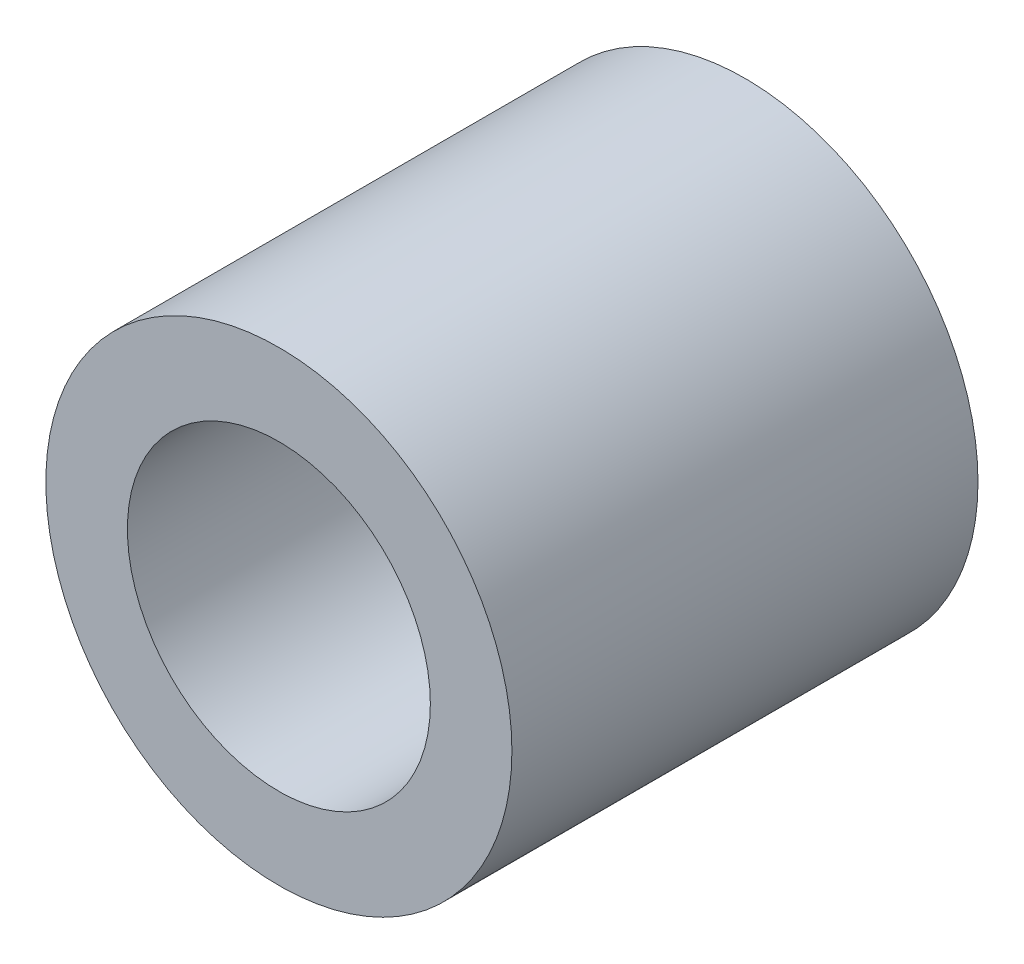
from build123d import *

# Parameters (mm, degrees)
SKETCH1_R      = 5
SKETCH1_R_2    = 3.25
EXTRUDE1_DEPTH = 10


with BuildPart() as part:
    # Sketch1 → Extrude1 (new body)
    with BuildSketch(Plane.XY):
        Circle(SKETCH1_R)
        Circle(SKETCH1_R_2, mode=Mode.SUBTRACT)
    extrude(amount=EXTRUDE1_DEPTH)


solid = part.part
